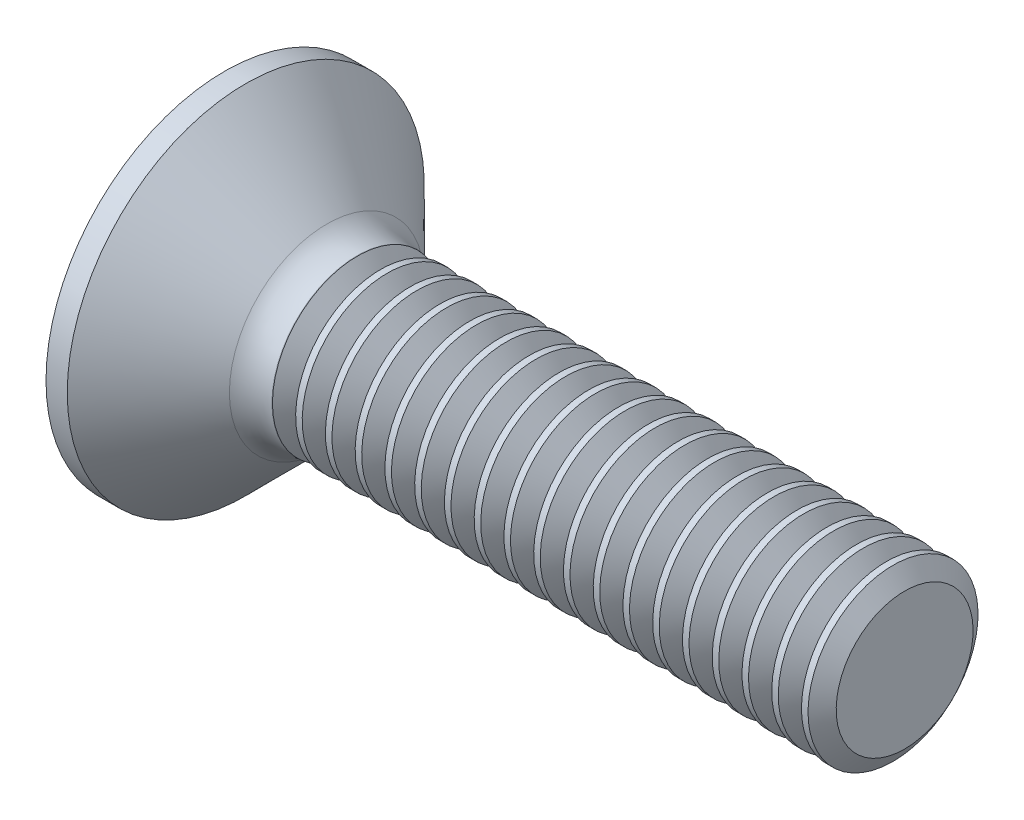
from build123d import *

# Parameters (mm, degrees)
FILLET1_R       = 1
RECPAT_COUNT    = 2
RECPAT_ANGLE    = 90
THDSCHPAT_COUNT = 19
THDSCHPAT_PITCH = 0.7


with BuildPart() as part:
    # BodySke → Base-Revolve (revolve)
    with BuildSketch(Plane.XY, mode=Mode.PRIVATE) as base_revolve_sk:
        with BuildLine():
            Line((0, 0), (17, 0))
            Line((17, 0), (17, 2))
            Line((17, 2), (3.7, 2))
            Line((3.7, 2), (1.5, 4.2))
            Line((1.5, 4.2), (1, 4.2))
            ThreePointArc((1, 4.2), (0.253446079, 2.158703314), (0, 0))
        make_face()
    revolve(base_revolve_sk.sketch.rotate(Axis((-15.875, 0, 0), (1, 0, 0)), 90), axis=Axis((-15.875, 0, 0), (1, 0, 0)))

    # Fillet1
    fillet1_edges = [part.edges().sort_by_distance(p)[0] for p in [
        (3.7, 0, -2),
    ]]
    fillet(fillet1_edges, radius=FILLET1_R)

    # Sketch3 → Recess section 0
    with BuildSketch(Plane(origin=(0, 0, 0), x_dir=(0, 0, -1), z_dir=(1, 0, 0))):
        with BuildLine():
            Line((0.515, -2.5), (-0.515, -2.5))
            Line((-0.515, -2.5), (-0.515, 2.5))
            Line((-0.515, 2.5), (0.515, 2.5))
            Line((0.515, 2.5), (0.515, -2.5))
        make_face()
    # Sketch4 → Recess section 1
    with BuildSketch(Plane(origin=(3.1, 0, 0), x_dir=(0, 0, -1), z_dir=(1, 0, 0))):
        with BuildLine():
            Line((0.515, -0.954397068), (-0.515, -0.954397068))
            Line((-0.515, -0.954397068), (-0.515, 0.954397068))
            Line((-0.515, 0.954397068), (0.515, 0.954397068))
            Line((0.515, 0.954397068), (0.515, -0.954397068))
        make_face()
    recess = loft(mode=Mode.SUBTRACT)

    # RecPat: Recess ×2 about axis
    recpat_axis = Axis((0, 0, 0), (1, 0, 0))
    for i in range(1, RECPAT_COUNT):
        add(recess.rotate(recpat_axis, i * RECPAT_ANGLE / (RECPAT_COUNT - 1)), mode=Mode.SUBTRACT)

    # RecCorSke → RecessCore (revolve, cut)
    with BuildSketch(Plane.XY, mode=Mode.PRIVATE) as recesscore_sk:
        Polygon((0, 0), (0, 1.067773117), (3.1, 0.851), (3.376506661, 0), align=None)
    revolve(recesscore_sk.sketch.rotate(Axis((-3.175, 0, 0), (1, 0, 0)), 90), axis=Axis((-3.175, 0, 0), (1, 0, 0)), mode=Mode.SUBTRACT)

    # ThdSchSke → ThreadSchematic (revolve, cut)
    with BuildSketch(Plane.XY):
        Polygon((4.4, -1.61), (4.12691906, -2), (4.12691906, -2.5), (4.67308094, -2.5), (4.67308094, -2), align=None)
    threadschematic = revolve(axis=Axis((-3.175, 0, 0), (1, 0, 0)), mode=Mode.SUBTRACT)

    # ThdSchPat: ThreadSchematic ×19
    with Locations(*[(i * THDSCHPAT_PITCH, 0, 0) for i in range(1, THDSCHPAT_COUNT)]):
        add(threadschematic, mode=Mode.SUBTRACT)


solid = part.part
